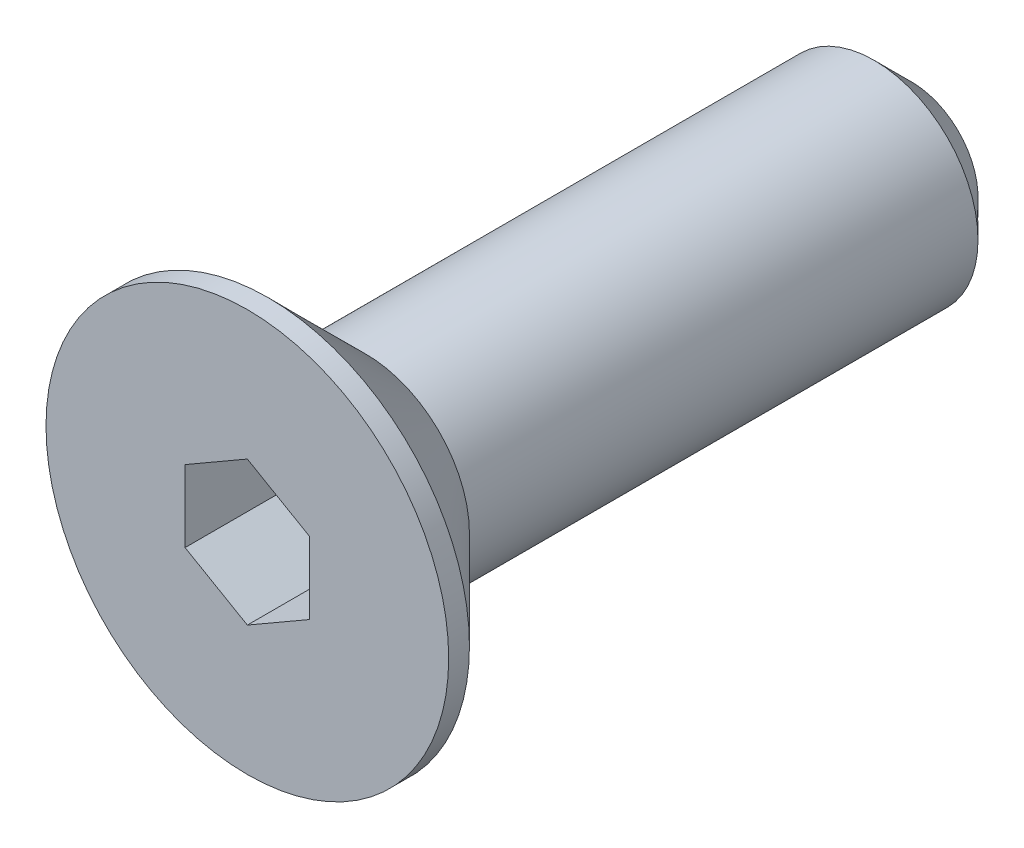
ISO-10303-21;
HEADER;
FILE_DESCRIPTION(('STEP AP214'),'2;1');
FILE_NAME('part.step','',(''),(''),'','','');
FILE_SCHEMA(('AUTOMOTIVE_DESIGN { 1 0 10303 214 1 1 1 1 }'));
ENDSEC;
DATA;
#1=APPLICATION_CONTEXT('core data for automotive mechanical design processes');
#2=APPLICATION_PROTOCOL_DEFINITION('international standard','automotive_design',2000,#1);
#3=PRODUCT_CONTEXT('',#1,'mechanical');
#4=PRODUCT('Part','Part','',(#3));
#5=PRODUCT_RELATED_PRODUCT_CATEGORY('part','',(#4));
#6=PRODUCT_DEFINITION_FORMATION('','',#4);
#7=PRODUCT_DEFINITION_CONTEXT('part definition',#1,'design');
#8=PRODUCT_DEFINITION('design','',#6,#7);
#9=PRODUCT_DEFINITION_SHAPE('','',#8);
#10=(LENGTH_UNIT() NAMED_UNIT(*) SI_UNIT(.MILLI.,.METRE.));
#11=(NAMED_UNIT(*) PLANE_ANGLE_UNIT() SI_UNIT($,.RADIAN.));
#12=(NAMED_UNIT(*) SI_UNIT($,.STERADIAN.) SOLID_ANGLE_UNIT());
#13=UNCERTAINTY_MEASURE_WITH_UNIT(LENGTH_MEASURE(1.E-05),#10,'distance_accuracy_value','');
#14=(GEOMETRIC_REPRESENTATION_CONTEXT(3) GLOBAL_UNCERTAINTY_ASSIGNED_CONTEXT((#13)) GLOBAL_UNIT_ASSIGNED_CONTEXT((#10,
#11,#12)) REPRESENTATION_CONTEXT('',''));
#15=CARTESIAN_POINT('',(0.,0.,0.));
#16=DIRECTION('',(0.,0.,1.));
#17=DIRECTION('',(1.,0.,0.));
#18=AXIS2_PLACEMENT_3D('',#15,#16,#17);
#19=CARTESIAN_POINT('',(0.,0.,0.));
#20=DIRECTION('',(0.,0.,1.));
#21=DIRECTION('',(1.,0.,0.));
#22=AXIS2_PLACEMENT_3D('',#19,#20,#21);
#23=PLANE('',#22);
#24=DIRECTION('',(0.866025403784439,-0.5,0.));
#25=VECTOR('',#24,1.);
#26=CARTESIAN_POINT('',(-1.5,-0.866025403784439,0.));
#27=LINE('',#26,#25);
#28=CARTESIAN_POINT('',(-1.5,-0.866025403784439,0.));
#29=VERTEX_POINT('',#28);
#30=CARTESIAN_POINT('',(0.,-1.73205080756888,0.));
#31=VERTEX_POINT('',#30);
#32=EDGE_CURVE('E29',#29,#31,#27,.T.);
#33=ORIENTED_EDGE('',*,*,#32,.F.);
#34=DIRECTION('',(0.,-1.,0.));
#35=VECTOR('',#34,1.);
#36=CARTESIAN_POINT('',(-1.5,0.866025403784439,0.));
#37=LINE('',#36,#35);
#38=CARTESIAN_POINT('',(-1.5,0.866025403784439,0.));
#39=VERTEX_POINT('',#38);
#40=EDGE_CURVE('E98',#39,#29,#37,.T.);
#41=ORIENTED_EDGE('',*,*,#40,.F.);
#42=DIRECTION('',(-0.866025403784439,-0.5,0.));
#43=VECTOR('',#42,1.);
#44=CARTESIAN_POINT('',(0.,1.73205080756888,0.));
#45=LINE('',#44,#43);
#46=CARTESIAN_POINT('',(0.,1.73205080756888,0.));
#47=VERTEX_POINT('',#46);
#48=EDGE_CURVE('E92',#47,#39,#45,.T.);
#49=ORIENTED_EDGE('',*,*,#48,.F.);
#50=DIRECTION('',(-0.866025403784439,0.5,0.));
#51=VECTOR('',#50,1.);
#52=CARTESIAN_POINT('',(1.5,0.866025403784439,0.));
#53=LINE('',#52,#51);
#54=CARTESIAN_POINT('',(1.5,0.866025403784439,0.));
#55=VERTEX_POINT('',#54);
#56=EDGE_CURVE('E90',#55,#47,#53,.T.);
#57=ORIENTED_EDGE('',*,*,#56,.F.);
#58=DIRECTION('',(0.,1.,0.));
#59=VECTOR('',#58,1.);
#60=CARTESIAN_POINT('',(1.5,-0.866025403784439,0.));
#61=LINE('',#60,#59);
#62=CARTESIAN_POINT('',(1.5,-0.866025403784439,0.));
#63=VERTEX_POINT('',#62);
#64=EDGE_CURVE('E72',#63,#55,#61,.T.);
#65=ORIENTED_EDGE('',*,*,#64,.F.);
#66=DIRECTION('',(0.866025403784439,0.5,0.));
#67=VECTOR('',#66,1.);
#68=CARTESIAN_POINT('',(0.,-1.73205080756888,0.));
#69=LINE('',#68,#67);
#70=EDGE_CURVE('E83',#31,#63,#69,.T.);
#71=ORIENTED_EDGE('',*,*,#70,.F.);
#72=EDGE_LOOP('',(#33,#41,#49,#57,#65,#71));
#73=FACE_BOUND('',#72,.T.);
#74=CARTESIAN_POINT('',(0.,0.,0.));
#75=DIRECTION('',(0.,0.,1.));
#76=DIRECTION('',(1.,0.,0.));
#77=AXIS2_PLACEMENT_3D('',#74,#75,#76);
#78=CIRCLE('',#77,4.85);
#79=CARTESIAN_POINT('',(4.85,0.,0.));
#80=VERTEX_POINT('',#79);
#81=EDGE_CURVE('E128',#80,#80,#78,.T.);
#82=ORIENTED_EDGE('',*,*,#81,.T.);
#83=EDGE_LOOP('',(#82));
#84=FACE_BOUND('',#83,.T.);
#85=ADVANCED_FACE('F14',(#73,#84),#23,.T.);
#86=CARTESIAN_POINT('',(0.,0.,6.05968084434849));
#87=DIRECTION('',(0.,0.,1.));
#88=DIRECTION('',(1.,0.,0.));
#89=AXIS2_PLACEMENT_3D('',#86,#87,#88);
#90=CYLINDRICAL_SURFACE('',#89,4.85);
#91=CARTESIAN_POINT('',(0.,0.,-0.5));
#92=DIRECTION('',(0.,0.,1.));
#93=DIRECTION('',(1.,0.,0.));
#94=AXIS2_PLACEMENT_3D('',#91,#92,#93);
#95=CIRCLE('',#94,4.85);
#96=CARTESIAN_POINT('',(4.85,0.,-0.5));
#97=VERTEX_POINT('',#96);
#98=EDGE_CURVE('E125',#97,#97,#95,.T.);
#99=ORIENTED_EDGE('',*,*,#98,.T.);
#100=EDGE_LOOP('',(#99));
#101=FACE_BOUND('',#100,.T.);
#102=ORIENTED_EDGE('',*,*,#81,.F.);
#103=EDGE_LOOP('',(#102));
#104=FACE_BOUND('',#103,.T.);
#105=ADVANCED_FACE('F148',(#101,#104),#90,.T.);
#106=CARTESIAN_POINT('',(0.,0.,-0.5));
#107=DIRECTION('',(0.,0.,1.));
#108=DIRECTION('',(1.,0.,0.));
#109=AXIS2_PLACEMENT_3D('',#106,#107,#108);
#110=CONICAL_SURFACE('',#109,4.85,0.78539816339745);
#111=CARTESIAN_POINT('',(0.,0.,-2.85));
#112=DIRECTION('',(0.,0.,1.));
#113=DIRECTION('',(1.,0.,0.));
#114=AXIS2_PLACEMENT_3D('',#111,#112,#113);
#115=CIRCLE('',#114,2.5);
#116=CARTESIAN_POINT('',(2.5,0.,-2.85));
#117=VERTEX_POINT('',#116);
#118=EDGE_CURVE('E116',#117,#117,#115,.T.);
#119=ORIENTED_EDGE('',*,*,#118,.T.);
#120=EDGE_LOOP('',(#119));
#121=FACE_BOUND('',#120,.T.);
#122=ORIENTED_EDGE('',*,*,#98,.F.);
#123=EDGE_LOOP('',(#122));
#124=FACE_BOUND('',#123,.T.);
#125=ADVANCED_FACE('F153',(#121,#124),#110,.T.);
#126=CARTESIAN_POINT('',(0.,0.,6.05968084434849));
#127=DIRECTION('',(0.,0.,1.));
#128=DIRECTION('',(1.,0.,0.));
#129=AXIS2_PLACEMENT_3D('',#126,#127,#128);
#130=CYLINDRICAL_SURFACE('',#129,2.5);
#131=CARTESIAN_POINT('',(0.,0.,-15.1));
#132=DIRECTION('',(0.,0.,-1.));
#133=DIRECTION('',(-1.,0.,0.));
#134=AXIS2_PLACEMENT_3D('',#131,#132,#133);
#135=CIRCLE('',#134,2.5);
#136=CARTESIAN_POINT('',(-2.5,0.,-15.1));
#137=VERTEX_POINT('',#136);
#138=EDGE_CURVE('E22',#137,#137,#135,.F.);
#139=ORIENTED_EDGE('',*,*,#138,.T.);
#140=EDGE_LOOP('',(#139));
#141=FACE_BOUND('',#140,.T.);
#142=ORIENTED_EDGE('',*,*,#118,.F.);
#143=EDGE_LOOP('',(#142));
#144=FACE_BOUND('',#143,.T.);
#145=ADVANCED_FACE('F133',(#141,#144),#130,.T.);
#146=CARTESIAN_POINT('',(2.5,0.,-16.));
#147=DIRECTION('',(0.,0.,-1.));
#148=DIRECTION('',(-1.,0.,0.));
#149=AXIS2_PLACEMENT_3D('',#146,#147,#148);
#150=PLANE('',#149);
#151=CARTESIAN_POINT('',(0.,0.,-16.));
#152=DIRECTION('',(0.,0.,-1.));
#153=DIRECTION('',(-1.,0.,0.));
#154=AXIS2_PLACEMENT_3D('',#151,#152,#153);
#155=CIRCLE('',#154,1.6);
#156=CARTESIAN_POINT('',(-1.6,0.,-16.));
#157=VERTEX_POINT('',#156);
#158=EDGE_CURVE('E9',#157,#157,#155,.T.);
#159=ORIENTED_EDGE('',*,*,#158,.T.);
#160=EDGE_LOOP('',(#159));
#161=FACE_BOUND('',#160,.T.);
#162=ADVANCED_FACE('F162',(#161),#150,.T.);
#163=CARTESIAN_POINT('',(-1.5,-0.866025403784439,-2.5));
#164=DIRECTION('',(-0.5,-0.866025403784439,0.));
#165=DIRECTION('',(0.866025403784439,-0.5,0.));
#166=AXIS2_PLACEMENT_3D('',#163,#164,#165);
#167=PLANE('',#166);
#168=ORIENTED_EDGE('',*,*,#32,.T.);
#169=DIRECTION('',(0.,0.,1.));
#170=VECTOR('',#169,1.);
#171=CARTESIAN_POINT('',(0.,-1.73205080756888,-2.5));
#172=LINE('',#171,#170);
#173=CARTESIAN_POINT('',(0.,-1.73205080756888,-2.5));
#174=VERTEX_POINT('',#173);
#175=EDGE_CURVE('E80',#174,#31,#172,.T.);
#176=ORIENTED_EDGE('',*,*,#175,.F.);
#177=DIRECTION('',(0.866025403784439,-0.5,0.));
#178=VECTOR('',#177,1.);
#179=CARTESIAN_POINT('',(-1.5,-0.866025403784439,-2.5));
#180=LINE('',#179,#178);
#181=CARTESIAN_POINT('',(-1.5,-0.866025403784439,-2.5));
#182=VERTEX_POINT('',#181);
#183=EDGE_CURVE('E100',#182,#174,#180,.T.);
#184=ORIENTED_EDGE('',*,*,#183,.F.);
#185=DIRECTION('',(0.,0.,1.));
#186=VECTOR('',#185,1.);
#187=CARTESIAN_POINT('',(-1.5,-0.866025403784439,-2.5));
#188=LINE('',#187,#186);
#189=EDGE_CURVE('E36',#182,#29,#188,.T.);
#190=ORIENTED_EDGE('',*,*,#189,.T.);
#191=EDGE_LOOP('',(#168,#176,#184,#190));
#192=FACE_BOUND('',#191,.T.);
#193=ADVANCED_FACE('F165',(#192),#167,.F.);
#194=CARTESIAN_POINT('',(-1.5,0.866025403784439,-2.5));
#195=DIRECTION('',(-1.,0.,0.));
#196=DIRECTION('',(0.,0.,1.));
#197=AXIS2_PLACEMENT_3D('',#194,#195,#196);
#198=PLANE('',#197);
#199=ORIENTED_EDGE('',*,*,#40,.T.);
#200=ORIENTED_EDGE('',*,*,#189,.F.);
#201=DIRECTION('',(0.,-1.,0.));
#202=VECTOR('',#201,1.);
#203=CARTESIAN_POINT('',(-1.5,0.866025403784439,-2.5));
#204=LINE('',#203,#202);
#205=CARTESIAN_POINT('',(-1.5,0.866025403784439,-2.5));
#206=VERTEX_POINT('',#205);
#207=EDGE_CURVE('E112',#206,#182,#204,.T.);
#208=ORIENTED_EDGE('',*,*,#207,.F.);
#209=DIRECTION('',(0.,0.,1.));
#210=VECTOR('',#209,1.);
#211=CARTESIAN_POINT('',(-1.5,0.866025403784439,-2.5));
#212=LINE('',#211,#210);
#213=EDGE_CURVE('E117',#206,#39,#212,.T.);
#214=ORIENTED_EDGE('',*,*,#213,.T.);
#215=EDGE_LOOP('',(#199,#200,#208,#214));
#216=FACE_BOUND('',#215,.T.);
#217=ADVANCED_FACE('F169',(#216),#198,.F.);
#218=CARTESIAN_POINT('',(0.,1.73205080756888,-2.5));
#219=DIRECTION('',(-0.5,0.866025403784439,0.));
#220=DIRECTION('',(-0.866025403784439,-0.5,0.));
#221=AXIS2_PLACEMENT_3D('',#218,#219,#220);
#222=PLANE('',#221);
#223=ORIENTED_EDGE('',*,*,#48,.T.);
#224=ORIENTED_EDGE('',*,*,#213,.F.);
#225=DIRECTION('',(-0.866025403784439,-0.5,0.));
#226=VECTOR('',#225,1.);
#227=CARTESIAN_POINT('',(0.,1.73205080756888,-2.5));
#228=LINE('',#227,#226);
#229=CARTESIAN_POINT('',(0.,1.73205080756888,-2.5));
#230=VERTEX_POINT('',#229);
#231=EDGE_CURVE('E109',#230,#206,#228,.T.);
#232=ORIENTED_EDGE('',*,*,#231,.F.);
#233=DIRECTION('',(0.,0.,1.));
#234=VECTOR('',#233,1.);
#235=CARTESIAN_POINT('',(0.,1.73205080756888,-2.5));
#236=LINE('',#235,#234);
#237=EDGE_CURVE('E119',#230,#47,#236,.T.);
#238=ORIENTED_EDGE('',*,*,#237,.T.);
#239=EDGE_LOOP('',(#223,#224,#232,#238));
#240=FACE_BOUND('',#239,.T.);
#241=ADVANCED_FACE('F177',(#240),#222,.F.);
#242=CARTESIAN_POINT('',(1.5,0.866025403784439,-2.5));
#243=DIRECTION('',(0.5,0.866025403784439,0.));
#244=DIRECTION('',(-0.866025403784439,0.5,0.));
#245=AXIS2_PLACEMENT_3D('',#242,#243,#244);
#246=PLANE('',#245);
#247=ORIENTED_EDGE('',*,*,#56,.T.);
#248=ORIENTED_EDGE('',*,*,#237,.F.);
#249=DIRECTION('',(-0.866025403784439,0.5,0.));
#250=VECTOR('',#249,1.);
#251=CARTESIAN_POINT('',(1.5,0.866025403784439,-2.5));
#252=LINE('',#251,#250);
#253=CARTESIAN_POINT('',(1.5,0.866025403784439,-2.5));
#254=VERTEX_POINT('',#253);
#255=EDGE_CURVE('E106',#254,#230,#252,.T.);
#256=ORIENTED_EDGE('',*,*,#255,.F.);
#257=DIRECTION('',(0.,0.,1.));
#258=VECTOR('',#257,1.);
#259=CARTESIAN_POINT('',(1.5,0.866025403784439,-2.5));
#260=LINE('',#259,#258);
#261=EDGE_CURVE('E79',#254,#55,#260,.T.);
#262=ORIENTED_EDGE('',*,*,#261,.T.);
#263=EDGE_LOOP('',(#247,#248,#256,#262));
#264=FACE_BOUND('',#263,.T.);
#265=ADVANCED_FACE('F174',(#264),#246,.F.);
#266=CARTESIAN_POINT('',(1.5,-0.866025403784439,-2.5));
#267=DIRECTION('',(1.,0.,0.));
#268=DIRECTION('',(0.,1.,0.));
#269=AXIS2_PLACEMENT_3D('',#266,#267,#268);
#270=PLANE('',#269);
#271=ORIENTED_EDGE('',*,*,#64,.T.);
#272=ORIENTED_EDGE('',*,*,#261,.F.);
#273=DIRECTION('',(0.,1.,0.));
#274=VECTOR('',#273,1.);
#275=CARTESIAN_POINT('',(1.5,-0.866025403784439,-2.5));
#276=LINE('',#275,#274);
#277=CARTESIAN_POINT('',(1.5,-0.866025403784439,-2.5));
#278=VERTEX_POINT('',#277);
#279=EDGE_CURVE('E75',#278,#254,#276,.T.);
#280=ORIENTED_EDGE('',*,*,#279,.F.);
#281=DIRECTION('',(0.,0.,1.));
#282=VECTOR('',#281,1.);
#283=CARTESIAN_POINT('',(1.5,-0.866025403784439,-2.5));
#284=LINE('',#283,#282);
#285=EDGE_CURVE('E68',#278,#63,#284,.T.);
#286=ORIENTED_EDGE('',*,*,#285,.T.);
#287=EDGE_LOOP('',(#271,#272,#280,#286));
#288=FACE_BOUND('',#287,.T.);
#289=ADVANCED_FACE('F70',(#288),#270,.F.);
#290=CARTESIAN_POINT('',(0.,-1.73205080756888,-2.5));
#291=DIRECTION('',(0.5,-0.866025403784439,0.));
#292=DIRECTION('',(0.866025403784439,0.5,0.));
#293=AXIS2_PLACEMENT_3D('',#290,#291,#292);
#294=PLANE('',#293);
#295=ORIENTED_EDGE('',*,*,#70,.T.);
#296=ORIENTED_EDGE('',*,*,#285,.F.);
#297=DIRECTION('',(0.866025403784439,0.5,0.));
#298=VECTOR('',#297,1.);
#299=CARTESIAN_POINT('',(0.,-1.73205080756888,-2.5));
#300=LINE('',#299,#298);
#301=EDGE_CURVE('E103',#174,#278,#300,.T.);
#302=ORIENTED_EDGE('',*,*,#301,.F.);
#303=ORIENTED_EDGE('',*,*,#175,.T.);
#304=EDGE_LOOP('',(#295,#296,#302,#303));
#305=FACE_BOUND('',#304,.T.);
#306=ADVANCED_FACE('F84',(#305),#294,.F.);
#307=CARTESIAN_POINT('',(1.5,-2.59807621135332,-2.5));
#308=DIRECTION('',(0.,0.,1.));
#309=DIRECTION('',(1.,0.,0.));
#310=AXIS2_PLACEMENT_3D('',#307,#308,#309);
#311=PLANE('',#310);
#312=ORIENTED_EDGE('',*,*,#183,.T.);
#313=ORIENTED_EDGE('',*,*,#301,.T.);
#314=ORIENTED_EDGE('',*,*,#279,.T.);
#315=ORIENTED_EDGE('',*,*,#255,.T.);
#316=ORIENTED_EDGE('',*,*,#231,.T.);
#317=ORIENTED_EDGE('',*,*,#207,.T.);
#318=EDGE_LOOP('',(#312,#313,#314,#315,#316,#317));
#319=FACE_BOUND('',#318,.T.);
#320=ADVANCED_FACE('F137',(#319),#311,.T.);
#321=CARTESIAN_POINT('',(0.,0.,-15.1));
#322=DIRECTION('',(0.,0.,1.));
#323=DIRECTION('',(1.,0.,0.));
#324=AXIS2_PLACEMENT_3D('',#321,#322,#323);
#325=CONICAL_SURFACE('',#324,2.5,0.78539816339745);
#326=ORIENTED_EDGE('',*,*,#158,.F.);
#327=EDGE_LOOP('',(#326));
#328=FACE_BOUND('',#327,.T.);
#329=ORIENTED_EDGE('',*,*,#138,.F.);
#330=EDGE_LOOP('',(#329));
#331=FACE_BOUND('',#330,.T.);
#332=ADVANCED_FACE('F16',(#328,#331),#325,.T.);
#333=CLOSED_SHELL('',(#85,#105,#125,#145,#162,#193,#217,#241,#265,#289,#306,#320,#332));
#334=MANIFOLD_SOLID_BREP('B1',#333);
#335=ADVANCED_BREP_SHAPE_REPRESENTATION('',(#18,#334),#14);
#336=SHAPE_DEFINITION_REPRESENTATION(#9,#335);
ENDSEC;
END-ISO-10303-21;
